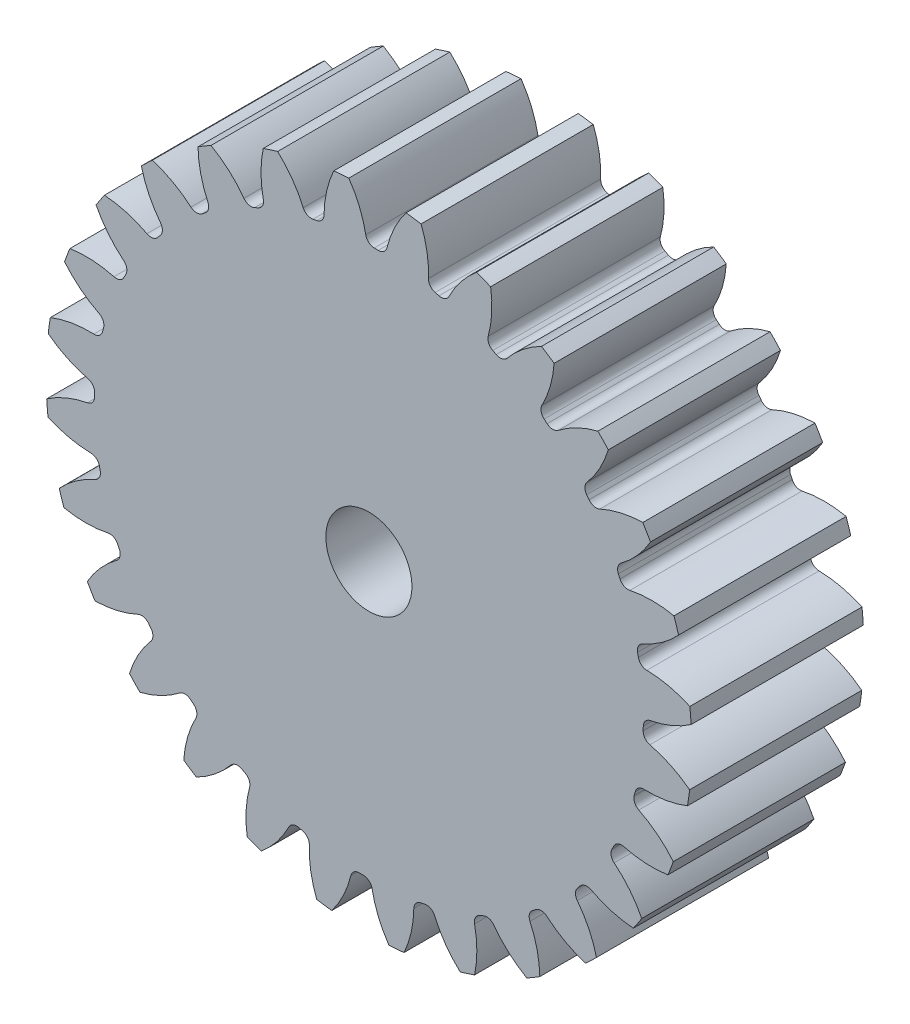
from build123d import *

# Parameters (mm, degrees)
SKETCH3_R         = 190.5
GEARBODY_DEPTH    = 101.6
TOOTHCUT_DEPTH    = 288.928914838
CIRPATTERN1_COUNT = 28
BOREDIA_R         = 25.4
BORE_DEPTH        = 12700


with BuildPart() as part:
    # Sketch3 → gearBody (new body)
    with BuildSketch(Plane.XY):
        Circle(SKETCH3_R)
    extrude(amount=GEARBODY_DEPTH)

    # Sketch2 → toothCut (cut, through all)
    with BuildSketch(Plane.XY):
        with BuildLine():
            ThreePointArc((161.832814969, -5.463114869), (161.867904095, -4.299680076), (161.894629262, -3.136023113))
            ThreePointArc((161.894629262, -3.136023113), (163.114603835, 0.100211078), (166.102094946, 1.842751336))
            ThreePointArc((166.102094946, 1.842751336), (178.843810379, 5.678057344), (190.5, 12.09632252))
            ThreePointArc((190.5, 12.09632252), (190.8163514, -5.068634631), (189.58918719, -22.19259154))
            ThreePointArc((189.58918719, -22.19259154), (178.290169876, -15.164569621), (165.770032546, -10.658235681))
            ThreePointArc((165.770032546, -10.658235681), (162.879262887, -8.759551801), (161.832814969, -5.463114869))
        make_face()
    toothcut = extrude(amount=TOOTHCUT_DEPTH, mode=Mode.SUBTRACT)

    # CirPattern1: toothCut ×28 about axis
    cirpattern1_axis = Axis((0, 0, 0), (0, 0, 1))
    for i in range(1, CIRPATTERN1_COUNT):
        add(toothcut.rotate(cirpattern1_axis, i * 360 / CIRPATTERN1_COUNT), mode=Mode.SUBTRACT)

    # boreDia → bore (cut, symmetric)
    with BuildSketch(Plane.XY):
        Circle(BOREDIA_R)
    extrude(amount=BORE_DEPTH, both=True, mode=Mode.SUBTRACT)


solid = part.part
